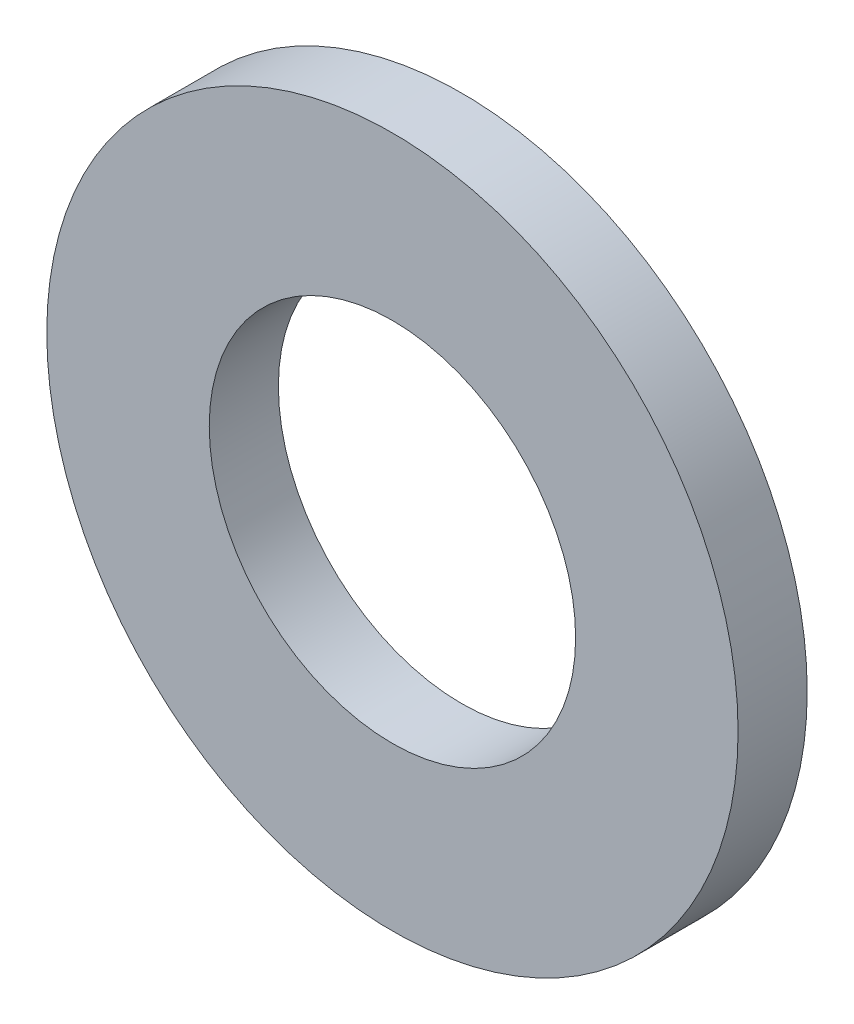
from build123d import *

# Parameters (mm, degrees)
SKIZZE1_R                       = 5
SKIZZE1_R_2                     = 2.65
AUFSATZ_LINEAR_AUSTRAGEN1_DEPTH = 1


with BuildPart() as part:
    # Skizze1 → Aufsatz-Linear austragen1 (new body)
    with BuildSketch(Plane.XY):
        Circle(SKIZZE1_R)
        Circle(SKIZZE1_R_2, mode=Mode.SUBTRACT)
    extrude(amount=AUFSATZ_LINEAR_AUSTRAGEN1_DEPTH)


solid = part.part
